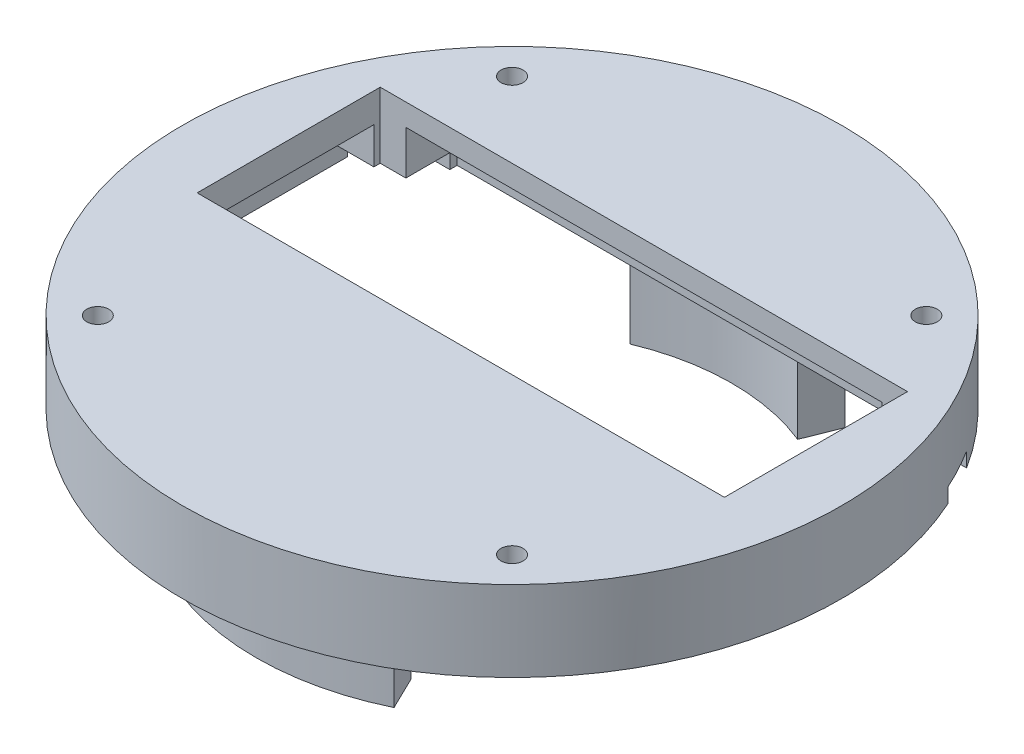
from build123d import *

# Parameters (mm, degrees)
SKETCH1_R           = 45
BOSS_EXTRUDE1_DEPTH = 11
CUT_EXTRUDE1_DEPTH  = 2
SKETCH3_W           = 72
SKETCH3_H           = 25
CUT_EXTRUDE2_DEPTH  = 9
SKETCH4_W           = 45
SKETCH4_H           = 5
SKETCH4_W_2         = 5
SKETCH4_H_2         = 24.138092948
CUT_EXTRUDE4_DEPTH  = 5
BOSS_EXTRUDE3_DEPTH = 12
SKETCH8_R           = 1.5
CUT_EXTRUDE5_DEPTH  = 11
SKETCH9_R           = 2.5
CUT_EXTRUDE6_DEPTH  = 4
SKETCH11_W          = 65
SKETCH11_H          = 50
CUT_EXTRUDE8_DEPTH  = 8


with BuildPart() as part:
    # Sketch1 → Boss-Extrude1 (new body)
    with BuildSketch(Plane(origin=(0, 0, 0), x_dir=(1, 0, 0), z_dir=(0, 1, 0))):
        with Locations(Location((0, 0, 0), (0, 0, 270))):
            Circle(SKETCH1_R)
    extrude(amount=BOSS_EXTRUDE1_DEPTH)

    # Sketch2 → Cut-Extrude1 (cut)
    with BuildSketch(Plane.XZ):
        with BuildLine():
            Line((-38.065732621, -24), (38.065732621, -24))
            ThreePointArc((38.065732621, -24), (39.626767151, -21.324148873), (41, -18.547236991))
            Line((41, -18.547236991), (41, 13))
            Line((41, 13), (-41, 13))
            Line((-41, 13), (-41, -18.547236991))
            ThreePointArc((-41, -18.547236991), (-39.626767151, -21.324148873), (-38.065732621, -24))
        make_face()
    extrude(amount=-CUT_EXTRUDE1_DEPTH, mode=Mode.SUBTRACT)

    # Sketch3 → Cut-Extrude2 (cut)
    with BuildSketch(Plane.XZ.offset(-2)):
        with Locations((0, -5.5)):
            Rectangle(SKETCH3_W, SKETCH3_H)
    extrude(amount=-CUT_EXTRUDE2_DEPTH, mode=Mode.SUBTRACT)

    # Sketch4 → Cut-Extrude4 (cut)
    with BuildSketch(Plane.XZ.offset(-2)):
        with Locations((13.5, 9.5)):
            Rectangle(SKETCH4_W, SKETCH4_H)
        with Locations((-38.5, -5.069046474)):
            Rectangle(SKETCH4_W_2, SKETCH4_H_2)
    extrude(amount=-CUT_EXTRUDE4_DEPTH, mode=Mode.SUBTRACT)

    # Sketch6 → Boss-Extrude3 (add)
    with BuildSketch(Plane.XZ):
        with BuildLine():
            Line((-13.140842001, 26.968838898), (-15.309080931, 31.418697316))
            ThreePointArc((-15.309080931, 31.418697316), (0, 34.95), (15.309080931, 31.418697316))
            Line((15.309080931, 31.418697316), (13.140842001, 26.968838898))
            ThreePointArc((13.140842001, 26.968838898), (0, 30), (-13.140842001, 26.968838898))
        make_face()
        with BuildLine():
            Line((-11.576931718, -27.676247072), (-13.487125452, -32.242827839))
            ThreePointArc((-13.487125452, -32.242827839), (-12.005657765, -32.823264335), (-10.499307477, -33.335672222))
            ThreePointArc((-10.499307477, -33.335672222), (0.76669389, -34.941589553), (11.951411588, -32.84305499))
            ThreePointArc((11.951411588, -32.84305499), (12.472591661, -32.648689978), (12.990612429, -32.446055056))
            Line((12.990612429, -32.446055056), (11.150740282, -27.850691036))
            ThreePointArc((11.150740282, -27.850691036), (10.706087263, -28.02462659), (10.258722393, -28.19146351))
            ThreePointArc((10.258722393, -28.19146351), (0.658106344, -29.992780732), (-9.012281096, -28.61431092))
            ThreePointArc((-9.012281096, -28.61431092), (-10.305285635, -28.174475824), (-11.576931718, -27.676247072))
        make_face()
    extrude(amount=BOSS_EXTRUDE3_DEPTH)

    # Sketch8 → Cut-Extrude5 (cut)
    with BuildSketch(Plane(origin=(0, 11, 0), x_dir=(1, 0, 0), z_dir=(0, 1, 0))):
        with Locations(Location((-28.284271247, 28.284271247, 0), (0, 0, 270))):
            Circle(SKETCH8_R)
        with Locations(Location((28.284271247, 28.284271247, 0), (0, 0, 270))):
            Circle(SKETCH8_R)
        with Locations(Location((28.284271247, -28.284271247, 0), (0, 0, 270))):
            Circle(SKETCH8_R)
        with Locations(Location((-28.284271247, -28.284271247, 0), (0, 0, 270))):
            Circle(SKETCH8_R)
    extrude(amount=-CUT_EXTRUDE5_DEPTH, mode=Mode.SUBTRACT)

    # Sketch9 → Cut-Extrude6 (cut)
    with BuildSketch(Plane.XZ):
        with Locations(Location((-28.284271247, 28.284271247, 0), (0, 0, 270))):
            Circle(SKETCH9_R)
        with Locations(Location((28.284271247, 28.284271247, 0), (0, 0, 270))):
            Circle(SKETCH9_R)
        with Locations(Location((-28.284271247, -28.284271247, 0), (0, 0, 270))):
            Circle(SKETCH9_R)
        with Locations(Location((28.284271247, -28.284271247, 0), (0, 0, 270))):
            Circle(SKETCH9_R)
    extrude(amount=-CUT_EXTRUDE6_DEPTH, mode=Mode.SUBTRACT)

    # Sketch11 → Cut-Extrude8 (cut)
    with BuildSketch(Plane.XZ):
        Rectangle(SKETCH11_W, SKETCH11_H)
    extrude(amount=-CUT_EXTRUDE8_DEPTH, mode=Mode.SUBTRACT)


solid = part.part
